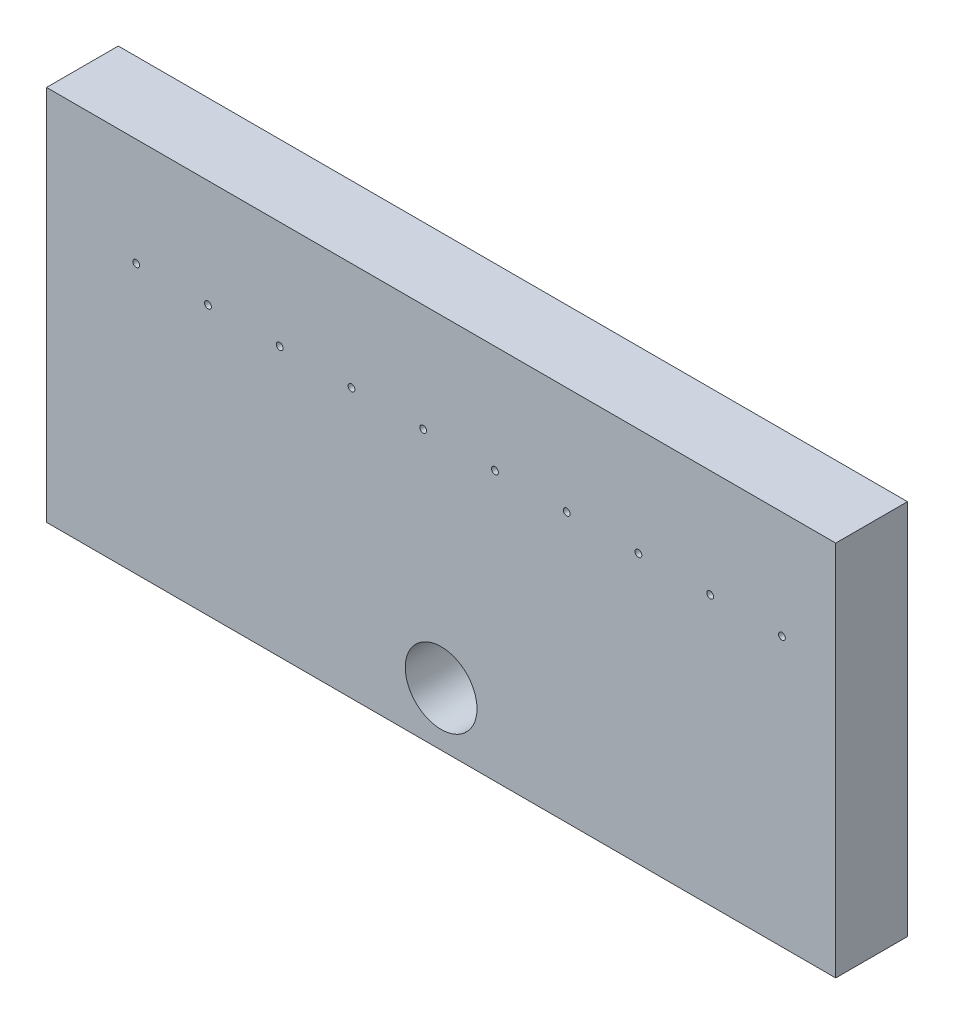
ISO-10303-21;
HEADER;
FILE_DESCRIPTION(('STEP AP214'),'2;1');
FILE_NAME('part.step','',(''),(''),'','','');
FILE_SCHEMA(('AUTOMOTIVE_DESIGN { 1 0 10303 214 1 1 1 1 }'));
ENDSEC;
DATA;
#1=APPLICATION_CONTEXT('core data for automotive mechanical design processes');
#2=APPLICATION_PROTOCOL_DEFINITION('international standard','automotive_design',2000,#1);
#3=PRODUCT_CONTEXT('',#1,'mechanical');
#4=PRODUCT('Part','Part','',(#3));
#5=PRODUCT_RELATED_PRODUCT_CATEGORY('part','',(#4));
#6=PRODUCT_DEFINITION_FORMATION('','',#4);
#7=PRODUCT_DEFINITION_CONTEXT('part definition',#1,'design');
#8=PRODUCT_DEFINITION('design','',#6,#7);
#9=PRODUCT_DEFINITION_SHAPE('','',#8);
#10=(LENGTH_UNIT() NAMED_UNIT(*) SI_UNIT(.MILLI.,.METRE.));
#11=(NAMED_UNIT(*) PLANE_ANGLE_UNIT() SI_UNIT($,.RADIAN.));
#12=(NAMED_UNIT(*) SI_UNIT($,.STERADIAN.) SOLID_ANGLE_UNIT());
#13=UNCERTAINTY_MEASURE_WITH_UNIT(LENGTH_MEASURE(1.E-05),#10,'distance_accuracy_value','');
#14=(GEOMETRIC_REPRESENTATION_CONTEXT(3) GLOBAL_UNCERTAINTY_ASSIGNED_CONTEXT((#13)) GLOBAL_UNIT_ASSIGNED_CONTEXT((#10,
#11,#12)) REPRESENTATION_CONTEXT('',''));
#15=CARTESIAN_POINT('',(0.,0.,0.));
#16=DIRECTION('',(0.,0.,1.));
#17=DIRECTION('',(1.,0.,0.));
#18=AXIS2_PLACEMENT_3D('',#15,#16,#17);
#19=CARTESIAN_POINT('',(1041.4,381.,50.8));
#20=DIRECTION('',(0.,0.,1.));
#21=DIRECTION('',(1.,0.,0.));
#22=AXIS2_PLACEMENT_3D('',#19,#20,#21);
#23=PLANE('',#22);
#24=CARTESIAN_POINT('',(1041.4,381.,50.8));
#25=DIRECTION('',(0.,0.,1.));
#26=DIRECTION('',(1.,0.,0.));
#27=AXIS2_PLACEMENT_3D('',#24,#25,#26);
#28=CIRCLE('',#27,4.826);
#29=CARTESIAN_POINT('',(1046.226,381.,50.8));
#30=VERTEX_POINT('',#29);
#31=EDGE_CURVE('E13',#30,#30,#28,.T.);
#32=ORIENTED_EDGE('',*,*,#31,.T.);
#33=EDGE_LOOP('',(#32));
#34=FACE_BOUND('',#33,.T.);
#35=ADVANCED_FACE('F44',(#34),#23,.T.);
#36=CARTESIAN_POINT('',(1041.4,381.,50.8));
#37=DIRECTION('',(0.,0.,1.));
#38=DIRECTION('',(1.,0.,0.));
#39=AXIS2_PLACEMENT_3D('',#36,#37,#38);
#40=CYLINDRICAL_SURFACE('',#39,4.826);
#41=ORIENTED_EDGE('',*,*,#31,.F.);
#42=EDGE_LOOP('',(#41));
#43=FACE_BOUND('',#42,.T.);
#44=CARTESIAN_POINT('',(1041.4,381.,101.6));
#45=DIRECTION('',(0.,0.,1.));
#46=DIRECTION('',(1.,0.,0.));
#47=AXIS2_PLACEMENT_3D('',#44,#45,#46);
#48=CIRCLE('',#47,4.826);
#49=CARTESIAN_POINT('',(1046.226,381.,101.6));
#50=VERTEX_POINT('',#49);
#51=EDGE_CURVE('E52',#50,#50,#48,.T.);
#52=ORIENTED_EDGE('',*,*,#51,.T.);
#53=EDGE_LOOP('',(#52));
#54=FACE_BOUND('',#53,.T.);
#55=ADVANCED_FACE('F166',(#43,#54),#40,.F.);
#56=CARTESIAN_POINT('',(939.8,381.,50.8));
#57=DIRECTION('',(0.,0.,1.));
#58=DIRECTION('',(1.,0.,0.));
#59=AXIS2_PLACEMENT_3D('',#56,#57,#58);
#60=PLANE('',#59);
#61=CARTESIAN_POINT('',(939.8,381.,50.8));
#62=DIRECTION('',(0.,0.,1.));
#63=DIRECTION('',(1.,0.,0.));
#64=AXIS2_PLACEMENT_3D('',#61,#62,#63);
#65=CIRCLE('',#64,4.826);
#66=CARTESIAN_POINT('',(944.626,381.,50.8));
#67=VERTEX_POINT('',#66);
#68=EDGE_CURVE('E161',#67,#67,#65,.T.);
#69=ORIENTED_EDGE('',*,*,#68,.T.);
#70=EDGE_LOOP('',(#69));
#71=FACE_BOUND('',#70,.T.);
#72=ADVANCED_FACE('F189',(#71),#60,.T.);
#73=CARTESIAN_POINT('',(939.8,381.,50.8));
#74=DIRECTION('',(0.,0.,1.));
#75=DIRECTION('',(1.,0.,0.));
#76=AXIS2_PLACEMENT_3D('',#73,#74,#75);
#77=CYLINDRICAL_SURFACE('',#76,4.826);
#78=ORIENTED_EDGE('',*,*,#68,.F.);
#79=EDGE_LOOP('',(#78));
#80=FACE_BOUND('',#79,.T.);
#81=CARTESIAN_POINT('',(939.8,381.,101.6));
#82=DIRECTION('',(0.,0.,1.));
#83=DIRECTION('',(1.,0.,0.));
#84=AXIS2_PLACEMENT_3D('',#81,#82,#83);
#85=CIRCLE('',#84,4.826);
#86=CARTESIAN_POINT('',(944.626,381.,101.6));
#87=VERTEX_POINT('',#86);
#88=EDGE_CURVE('E158',#87,#87,#85,.T.);
#89=ORIENTED_EDGE('',*,*,#88,.T.);
#90=EDGE_LOOP('',(#89));
#91=FACE_BOUND('',#90,.T.);
#92=ADVANCED_FACE('F195',(#80,#91),#77,.F.);
#93=CARTESIAN_POINT('',(838.2,381.,50.8));
#94=DIRECTION('',(0.,0.,1.));
#95=DIRECTION('',(1.,0.,0.));
#96=AXIS2_PLACEMENT_3D('',#93,#94,#95);
#97=PLANE('',#96);
#98=CARTESIAN_POINT('',(838.2,381.,50.8));
#99=DIRECTION('',(0.,0.,1.));
#100=DIRECTION('',(1.,0.,0.));
#101=AXIS2_PLACEMENT_3D('',#98,#99,#100);
#102=CIRCLE('',#101,4.826);
#103=CARTESIAN_POINT('',(843.026,381.,50.8));
#104=VERTEX_POINT('',#103);
#105=EDGE_CURVE('E155',#104,#104,#102,.T.);
#106=ORIENTED_EDGE('',*,*,#105,.T.);
#107=EDGE_LOOP('',(#106));
#108=FACE_BOUND('',#107,.T.);
#109=ADVANCED_FACE('F201',(#108),#97,.T.);
#110=CARTESIAN_POINT('',(838.2,381.,50.8));
#111=DIRECTION('',(0.,0.,1.));
#112=DIRECTION('',(1.,0.,0.));
#113=AXIS2_PLACEMENT_3D('',#110,#111,#112);
#114=CYLINDRICAL_SURFACE('',#113,4.826);
#115=ORIENTED_EDGE('',*,*,#105,.F.);
#116=EDGE_LOOP('',(#115));
#117=FACE_BOUND('',#116,.T.);
#118=CARTESIAN_POINT('',(838.2,381.,101.6));
#119=DIRECTION('',(0.,0.,1.));
#120=DIRECTION('',(1.,0.,0.));
#121=AXIS2_PLACEMENT_3D('',#118,#119,#120);
#122=CIRCLE('',#121,4.826);
#123=CARTESIAN_POINT('',(843.026,381.,101.6));
#124=VERTEX_POINT('',#123);
#125=EDGE_CURVE('E152',#124,#124,#122,.T.);
#126=ORIENTED_EDGE('',*,*,#125,.T.);
#127=EDGE_LOOP('',(#126));
#128=FACE_BOUND('',#127,.T.);
#129=ADVANCED_FACE('F205',(#117,#128),#114,.F.);
#130=CARTESIAN_POINT('',(736.6,381.,50.8));
#131=DIRECTION('',(0.,0.,1.));
#132=DIRECTION('',(1.,0.,0.));
#133=AXIS2_PLACEMENT_3D('',#130,#131,#132);
#134=PLANE('',#133);
#135=CARTESIAN_POINT('',(736.6,381.,50.8));
#136=DIRECTION('',(0.,0.,1.));
#137=DIRECTION('',(1.,0.,0.));
#138=AXIS2_PLACEMENT_3D('',#135,#136,#137);
#139=CIRCLE('',#138,4.826);
#140=CARTESIAN_POINT('',(741.426,381.,50.8));
#141=VERTEX_POINT('',#140);
#142=EDGE_CURVE('E149',#141,#141,#139,.T.);
#143=ORIENTED_EDGE('',*,*,#142,.T.);
#144=EDGE_LOOP('',(#143));
#145=FACE_BOUND('',#144,.T.);
#146=ADVANCED_FACE('F209',(#145),#134,.T.);
#147=CARTESIAN_POINT('',(736.6,381.,50.8));
#148=DIRECTION('',(0.,0.,1.));
#149=DIRECTION('',(1.,0.,0.));
#150=AXIS2_PLACEMENT_3D('',#147,#148,#149);
#151=CYLINDRICAL_SURFACE('',#150,4.826);
#152=ORIENTED_EDGE('',*,*,#142,.F.);
#153=EDGE_LOOP('',(#152));
#154=FACE_BOUND('',#153,.T.);
#155=CARTESIAN_POINT('',(736.6,381.,101.6));
#156=DIRECTION('',(0.,0.,1.));
#157=DIRECTION('',(1.,0.,0.));
#158=AXIS2_PLACEMENT_3D('',#155,#156,#157);
#159=CIRCLE('',#158,4.826);
#160=CARTESIAN_POINT('',(741.426,381.,101.6));
#161=VERTEX_POINT('',#160);
#162=EDGE_CURVE('E146',#161,#161,#159,.T.);
#163=ORIENTED_EDGE('',*,*,#162,.T.);
#164=EDGE_LOOP('',(#163));
#165=FACE_BOUND('',#164,.T.);
#166=ADVANCED_FACE('F213',(#154,#165),#151,.F.);
#167=CARTESIAN_POINT('',(635.,381.,50.8));
#168=DIRECTION('',(0.,0.,1.));
#169=DIRECTION('',(1.,0.,0.));
#170=AXIS2_PLACEMENT_3D('',#167,#168,#169);
#171=PLANE('',#170);
#172=CARTESIAN_POINT('',(635.,381.,50.8));
#173=DIRECTION('',(0.,0.,1.));
#174=DIRECTION('',(1.,0.,0.));
#175=AXIS2_PLACEMENT_3D('',#172,#173,#174);
#176=CIRCLE('',#175,4.826);
#177=CARTESIAN_POINT('',(639.826,381.,50.8));
#178=VERTEX_POINT('',#177);
#179=EDGE_CURVE('E143',#178,#178,#176,.T.);
#180=ORIENTED_EDGE('',*,*,#179,.T.);
#181=EDGE_LOOP('',(#180));
#182=FACE_BOUND('',#181,.T.);
#183=ADVANCED_FACE('F217',(#182),#171,.T.);
#184=CARTESIAN_POINT('',(635.,381.,50.8));
#185=DIRECTION('',(0.,0.,1.));
#186=DIRECTION('',(1.,0.,0.));
#187=AXIS2_PLACEMENT_3D('',#184,#185,#186);
#188=CYLINDRICAL_SURFACE('',#187,4.826);
#189=ORIENTED_EDGE('',*,*,#179,.F.);
#190=EDGE_LOOP('',(#189));
#191=FACE_BOUND('',#190,.T.);
#192=CARTESIAN_POINT('',(635.,381.,101.6));
#193=DIRECTION('',(0.,0.,1.));
#194=DIRECTION('',(1.,0.,0.));
#195=AXIS2_PLACEMENT_3D('',#192,#193,#194);
#196=CIRCLE('',#195,4.826);
#197=CARTESIAN_POINT('',(639.826,381.,101.6));
#198=VERTEX_POINT('',#197);
#199=EDGE_CURVE('E140',#198,#198,#196,.T.);
#200=ORIENTED_EDGE('',*,*,#199,.T.);
#201=EDGE_LOOP('',(#200));
#202=FACE_BOUND('',#201,.T.);
#203=ADVANCED_FACE('F221',(#191,#202),#188,.F.);
#204=CARTESIAN_POINT('',(533.4,381.,50.8));
#205=DIRECTION('',(0.,0.,1.));
#206=DIRECTION('',(1.,0.,0.));
#207=AXIS2_PLACEMENT_3D('',#204,#205,#206);
#208=PLANE('',#207);
#209=CARTESIAN_POINT('',(533.4,381.,50.8));
#210=DIRECTION('',(0.,0.,1.));
#211=DIRECTION('',(1.,0.,0.));
#212=AXIS2_PLACEMENT_3D('',#209,#210,#211);
#213=CIRCLE('',#212,4.826);
#214=CARTESIAN_POINT('',(538.226,381.,50.8));
#215=VERTEX_POINT('',#214);
#216=EDGE_CURVE('E137',#215,#215,#213,.T.);
#217=ORIENTED_EDGE('',*,*,#216,.T.);
#218=EDGE_LOOP('',(#217));
#219=FACE_BOUND('',#218,.T.);
#220=ADVANCED_FACE('F225',(#219),#208,.T.);
#221=CARTESIAN_POINT('',(533.4,381.,50.8));
#222=DIRECTION('',(0.,0.,1.));
#223=DIRECTION('',(1.,0.,0.));
#224=AXIS2_PLACEMENT_3D('',#221,#222,#223);
#225=CYLINDRICAL_SURFACE('',#224,4.826);
#226=ORIENTED_EDGE('',*,*,#216,.F.);
#227=EDGE_LOOP('',(#226));
#228=FACE_BOUND('',#227,.T.);
#229=CARTESIAN_POINT('',(533.4,381.,101.6));
#230=DIRECTION('',(0.,0.,1.));
#231=DIRECTION('',(1.,0.,0.));
#232=AXIS2_PLACEMENT_3D('',#229,#230,#231);
#233=CIRCLE('',#232,4.826);
#234=CARTESIAN_POINT('',(538.226,381.,101.6));
#235=VERTEX_POINT('',#234);
#236=EDGE_CURVE('E134',#235,#235,#233,.T.);
#237=ORIENTED_EDGE('',*,*,#236,.T.);
#238=EDGE_LOOP('',(#237));
#239=FACE_BOUND('',#238,.T.);
#240=ADVANCED_FACE('F229',(#228,#239),#225,.F.);
#241=CARTESIAN_POINT('',(431.8,381.,50.8));
#242=DIRECTION('',(0.,0.,1.));
#243=DIRECTION('',(1.,0.,0.));
#244=AXIS2_PLACEMENT_3D('',#241,#242,#243);
#245=PLANE('',#244);
#246=CARTESIAN_POINT('',(431.8,381.,50.8));
#247=DIRECTION('',(0.,0.,1.));
#248=DIRECTION('',(1.,0.,0.));
#249=AXIS2_PLACEMENT_3D('',#246,#247,#248);
#250=CIRCLE('',#249,4.826);
#251=CARTESIAN_POINT('',(436.626,381.,50.8));
#252=VERTEX_POINT('',#251);
#253=EDGE_CURVE('E131',#252,#252,#250,.T.);
#254=ORIENTED_EDGE('',*,*,#253,.T.);
#255=EDGE_LOOP('',(#254));
#256=FACE_BOUND('',#255,.T.);
#257=ADVANCED_FACE('F233',(#256),#245,.T.);
#258=CARTESIAN_POINT('',(431.8,381.,50.8));
#259=DIRECTION('',(0.,0.,1.));
#260=DIRECTION('',(1.,0.,0.));
#261=AXIS2_PLACEMENT_3D('',#258,#259,#260);
#262=CYLINDRICAL_SURFACE('',#261,4.826);
#263=ORIENTED_EDGE('',*,*,#253,.F.);
#264=EDGE_LOOP('',(#263));
#265=FACE_BOUND('',#264,.T.);
#266=CARTESIAN_POINT('',(431.8,381.,101.6));
#267=DIRECTION('',(0.,0.,1.));
#268=DIRECTION('',(1.,0.,0.));
#269=AXIS2_PLACEMENT_3D('',#266,#267,#268);
#270=CIRCLE('',#269,4.826);
#271=CARTESIAN_POINT('',(436.626,381.,101.6));
#272=VERTEX_POINT('',#271);
#273=EDGE_CURVE('E128',#272,#272,#270,.T.);
#274=ORIENTED_EDGE('',*,*,#273,.T.);
#275=EDGE_LOOP('',(#274));
#276=FACE_BOUND('',#275,.T.);
#277=ADVANCED_FACE('F237',(#265,#276),#262,.F.);
#278=CARTESIAN_POINT('',(330.2,381.,50.8));
#279=DIRECTION('',(0.,0.,1.));
#280=DIRECTION('',(1.,0.,0.));
#281=AXIS2_PLACEMENT_3D('',#278,#279,#280);
#282=PLANE('',#281);
#283=CARTESIAN_POINT('',(330.2,381.,50.8));
#284=DIRECTION('',(0.,0.,1.));
#285=DIRECTION('',(1.,0.,0.));
#286=AXIS2_PLACEMENT_3D('',#283,#284,#285);
#287=CIRCLE('',#286,4.826);
#288=CARTESIAN_POINT('',(335.026,381.,50.8));
#289=VERTEX_POINT('',#288);
#290=EDGE_CURVE('E125',#289,#289,#287,.T.);
#291=ORIENTED_EDGE('',*,*,#290,.T.);
#292=EDGE_LOOP('',(#291));
#293=FACE_BOUND('',#292,.T.);
#294=ADVANCED_FACE('F241',(#293),#282,.T.);
#295=CARTESIAN_POINT('',(330.2,381.,50.8));
#296=DIRECTION('',(0.,0.,1.));
#297=DIRECTION('',(1.,0.,0.));
#298=AXIS2_PLACEMENT_3D('',#295,#296,#297);
#299=CYLINDRICAL_SURFACE('',#298,4.826);
#300=ORIENTED_EDGE('',*,*,#290,.F.);
#301=EDGE_LOOP('',(#300));
#302=FACE_BOUND('',#301,.T.);
#303=CARTESIAN_POINT('',(330.2,381.,101.6));
#304=DIRECTION('',(0.,0.,1.));
#305=DIRECTION('',(1.,0.,0.));
#306=AXIS2_PLACEMENT_3D('',#303,#304,#305);
#307=CIRCLE('',#306,4.826);
#308=CARTESIAN_POINT('',(335.026,381.,101.6));
#309=VERTEX_POINT('',#308);
#310=EDGE_CURVE('E122',#309,#309,#307,.T.);
#311=ORIENTED_EDGE('',*,*,#310,.T.);
#312=EDGE_LOOP('',(#311));
#313=FACE_BOUND('',#312,.T.);
#314=ADVANCED_FACE('F245',(#302,#313),#299,.F.);
#315=CARTESIAN_POINT('',(0.,0.,101.6));
#316=DIRECTION('',(1.,0.,0.));
#317=DIRECTION('',(0.,0.,-1.));
#318=AXIS2_PLACEMENT_3D('',#315,#316,#317);
#319=PLANE('',#318);
#320=DIRECTION('',(0.,-1.,0.));
#321=VECTOR('',#320,1.);
#322=CARTESIAN_POINT('',(0.,0.,0.));
#323=LINE('',#322,#321);
#324=CARTESIAN_POINT('',(0.,533.4,0.));
#325=VERTEX_POINT('',#324);
#326=CARTESIAN_POINT('',(0.,0.,0.));
#327=VERTEX_POINT('',#326);
#328=EDGE_CURVE('E112',#325,#327,#323,.T.);
#329=ORIENTED_EDGE('',*,*,#328,.T.);
#330=DIRECTION('',(0.,0.,-1.));
#331=VECTOR('',#330,1.);
#332=CARTESIAN_POINT('',(0.,0.,101.6));
#333=LINE('',#332,#331);
#334=CARTESIAN_POINT('',(0.,0.,101.6));
#335=VERTEX_POINT('',#334);
#336=EDGE_CURVE('E103',#335,#327,#333,.T.);
#337=ORIENTED_EDGE('',*,*,#336,.F.);
#338=DIRECTION('',(0.,-1.,0.));
#339=VECTOR('',#338,1.);
#340=CARTESIAN_POINT('',(0.,0.,101.6));
#341=LINE('',#340,#339);
#342=CARTESIAN_POINT('',(0.,533.4,101.6));
#343=VERTEX_POINT('',#342);
#344=EDGE_CURVE('E97',#343,#335,#341,.T.);
#345=ORIENTED_EDGE('',*,*,#344,.F.);
#346=DIRECTION('',(0.,0.,-1.));
#347=VECTOR('',#346,1.);
#348=CARTESIAN_POINT('',(0.,533.4,101.6));
#349=LINE('',#348,#347);
#350=EDGE_CURVE('E108',#343,#325,#349,.T.);
#351=ORIENTED_EDGE('',*,*,#350,.T.);
#352=EDGE_LOOP('',(#329,#337,#345,#351));
#353=FACE_BOUND('',#352,.T.);
#354=ADVANCED_FACE('F249',(#353),#319,.F.);
#355=CARTESIAN_POINT('',(0.,0.,101.6));
#356=DIRECTION('',(0.,1.,0.));
#357=DIRECTION('',(0.,0.,1.));
#358=AXIS2_PLACEMENT_3D('',#355,#356,#357);
#359=PLANE('',#358);
#360=DIRECTION('',(1.,0.,0.));
#361=VECTOR('',#360,1.);
#362=CARTESIAN_POINT('',(0.,0.,0.));
#363=LINE('',#362,#361);
#364=CARTESIAN_POINT('',(1117.6,0.,0.));
#365=VERTEX_POINT('',#364);
#366=EDGE_CURVE('E102',#327,#365,#363,.T.);
#367=ORIENTED_EDGE('',*,*,#366,.T.);
#368=DIRECTION('',(0.,0.,-1.));
#369=VECTOR('',#368,1.);
#370=CARTESIAN_POINT('',(1117.6,0.,101.6));
#371=LINE('',#370,#369);
#372=CARTESIAN_POINT('',(1117.6,0.,101.6));
#373=VERTEX_POINT('',#372);
#374=EDGE_CURVE('E100',#373,#365,#371,.T.);
#375=ORIENTED_EDGE('',*,*,#374,.F.);
#376=DIRECTION('',(1.,0.,0.));
#377=VECTOR('',#376,1.);
#378=CARTESIAN_POINT('',(0.,0.,101.6));
#379=LINE('',#378,#377);
#380=EDGE_CURVE('E91',#335,#373,#379,.T.);
#381=ORIENTED_EDGE('',*,*,#380,.F.);
#382=ORIENTED_EDGE('',*,*,#336,.T.);
#383=EDGE_LOOP('',(#367,#375,#381,#382));
#384=FACE_BOUND('',#383,.T.);
#385=ADVANCED_FACE('F101',(#384),#359,.F.);
#386=CARTESIAN_POINT('',(1117.6,0.,101.6));
#387=DIRECTION('',(-1.,0.,0.));
#388=DIRECTION('',(0.,0.,1.));
#389=AXIS2_PLACEMENT_3D('',#386,#387,#388);
#390=PLANE('',#389);
#391=DIRECTION('',(0.,1.,0.));
#392=VECTOR('',#391,1.);
#393=CARTESIAN_POINT('',(1117.6,0.,0.));
#394=LINE('',#393,#392);
#395=CARTESIAN_POINT('',(1117.6,533.4,0.));
#396=VERTEX_POINT('',#395);
#397=EDGE_CURVE('E77',#365,#396,#394,.T.);
#398=ORIENTED_EDGE('',*,*,#397,.T.);
#399=DIRECTION('',(0.,0.,-1.));
#400=VECTOR('',#399,1.);
#401=CARTESIAN_POINT('',(1117.6,533.4,101.6));
#402=LINE('',#401,#400);
#403=CARTESIAN_POINT('',(1117.6,533.4,101.6));
#404=VERTEX_POINT('',#403);
#405=EDGE_CURVE('E104',#404,#396,#402,.T.);
#406=ORIENTED_EDGE('',*,*,#405,.F.);
#407=DIRECTION('',(0.,1.,0.));
#408=VECTOR('',#407,1.);
#409=CARTESIAN_POINT('',(1117.6,0.,101.6));
#410=LINE('',#409,#408);
#411=EDGE_CURVE('E95',#373,#404,#410,.T.);
#412=ORIENTED_EDGE('',*,*,#411,.F.);
#413=ORIENTED_EDGE('',*,*,#374,.T.);
#414=EDGE_LOOP('',(#398,#406,#412,#413));
#415=FACE_BOUND('',#414,.T.);
#416=ADVANCED_FACE('F106',(#415),#390,.F.);
#417=CARTESIAN_POINT('',(0.,533.4,101.6));
#418=DIRECTION('',(0.,-1.,0.));
#419=DIRECTION('',(0.,0.,-1.));
#420=AXIS2_PLACEMENT_3D('',#417,#418,#419);
#421=PLANE('',#420);
#422=DIRECTION('',(-1.,0.,0.));
#423=VECTOR('',#422,1.);
#424=CARTESIAN_POINT('',(0.,533.4,0.));
#425=LINE('',#424,#423);
#426=EDGE_CURVE('E83',#396,#325,#425,.T.);
#427=ORIENTED_EDGE('',*,*,#426,.T.);
#428=ORIENTED_EDGE('',*,*,#350,.F.);
#429=DIRECTION('',(-1.,0.,0.));
#430=VECTOR('',#429,1.);
#431=CARTESIAN_POINT('',(0.,533.4,101.6));
#432=LINE('',#431,#430);
#433=EDGE_CURVE('E60',#404,#343,#432,.T.);
#434=ORIENTED_EDGE('',*,*,#433,.F.);
#435=ORIENTED_EDGE('',*,*,#405,.T.);
#436=EDGE_LOOP('',(#427,#428,#434,#435));
#437=FACE_BOUND('',#436,.T.);
#438=ADVANCED_FACE('F170',(#437),#421,.F.);
#439=CARTESIAN_POINT('',(0.,0.,101.6));
#440=DIRECTION('',(0.,0.,-1.));
#441=DIRECTION('',(-1.,0.,0.));
#442=AXIS2_PLACEMENT_3D('',#439,#440,#441);
#443=PLANE('',#442);
#444=CARTESIAN_POINT('',(558.8,76.2,101.6));
#445=DIRECTION('',(0.,0.,1.));
#446=DIRECTION('',(1.,0.,0.));
#447=AXIS2_PLACEMENT_3D('',#444,#445,#446);
#448=CIRCLE('',#447,50.8);
#449=CARTESIAN_POINT('',(609.6,76.2,101.6));
#450=VERTEX_POINT('',#449);
#451=EDGE_CURVE('E424',#450,#450,#448,.T.);
#452=ORIENTED_EDGE('',*,*,#451,.F.);
#453=EDGE_LOOP('',(#452));
#454=FACE_BOUND('',#453,.T.);
#455=CARTESIAN_POINT('',(228.6,381.,101.6));
#456=DIRECTION('',(0.,0.,1.));
#457=DIRECTION('',(1.,0.,0.));
#458=AXIS2_PLACEMENT_3D('',#455,#456,#457);
#459=CIRCLE('',#458,4.826);
#460=CARTESIAN_POINT('',(233.426,381.,101.6));
#461=VERTEX_POINT('',#460);
#462=EDGE_CURVE('E426',#461,#461,#459,.T.);
#463=ORIENTED_EDGE('',*,*,#462,.F.);
#464=EDGE_LOOP('',(#463));
#465=FACE_BOUND('',#464,.T.);
#466=CARTESIAN_POINT('',(127.,381.,101.6));
#467=DIRECTION('',(0.,0.,1.));
#468=DIRECTION('',(1.,0.,0.));
#469=AXIS2_PLACEMENT_3D('',#466,#467,#468);
#470=CIRCLE('',#469,4.826);
#471=CARTESIAN_POINT('',(131.826,381.,101.6));
#472=VERTEX_POINT('',#471);
#473=EDGE_CURVE('E434',#472,#472,#470,.T.);
#474=ORIENTED_EDGE('',*,*,#473,.F.);
#475=EDGE_LOOP('',(#474));
#476=FACE_BOUND('',#475,.T.);
#477=ORIENTED_EDGE('',*,*,#344,.T.);
#478=ORIENTED_EDGE('',*,*,#380,.T.);
#479=ORIENTED_EDGE('',*,*,#411,.T.);
#480=ORIENTED_EDGE('',*,*,#433,.T.);
#481=EDGE_LOOP('',(#477,#478,#479,#480));
#482=FACE_BOUND('',#481,.T.);
#483=ORIENTED_EDGE('',*,*,#310,.F.);
#484=EDGE_LOOP('',(#483));
#485=FACE_BOUND('',#484,.T.);
#486=ORIENTED_EDGE('',*,*,#273,.F.);
#487=EDGE_LOOP('',(#486));
#488=FACE_BOUND('',#487,.T.);
#489=ORIENTED_EDGE('',*,*,#236,.F.);
#490=EDGE_LOOP('',(#489));
#491=FACE_BOUND('',#490,.T.);
#492=ORIENTED_EDGE('',*,*,#199,.F.);
#493=EDGE_LOOP('',(#492));
#494=FACE_BOUND('',#493,.T.);
#495=ORIENTED_EDGE('',*,*,#162,.F.);
#496=EDGE_LOOP('',(#495));
#497=FACE_BOUND('',#496,.T.);
#498=ORIENTED_EDGE('',*,*,#125,.F.);
#499=EDGE_LOOP('',(#498));
#500=FACE_BOUND('',#499,.T.);
#501=ORIENTED_EDGE('',*,*,#88,.F.);
#502=EDGE_LOOP('',(#501));
#503=FACE_BOUND('',#502,.T.);
#504=ORIENTED_EDGE('',*,*,#51,.F.);
#505=EDGE_LOOP('',(#504));
#506=FACE_BOUND('',#505,.T.);
#507=ADVANCED_FACE('F92',(#454,#465,#476,#482,#485,#488,#491,#494,#497,#500,#503,#506),#443,.F.);
#508=CARTESIAN_POINT('',(0.,0.,0.));
#509=DIRECTION('',(0.,0.,-1.));
#510=DIRECTION('',(-1.,0.,0.));
#511=AXIS2_PLACEMENT_3D('',#508,#509,#510);
#512=PLANE('',#511);
#513=CARTESIAN_POINT('',(558.8,76.2,0.));
#514=DIRECTION('',(0.,0.,1.));
#515=DIRECTION('',(1.,0.,0.));
#516=AXIS2_PLACEMENT_3D('',#513,#514,#515);
#517=CIRCLE('',#516,50.8);
#518=CARTESIAN_POINT('',(609.6,76.2,0.));
#519=VERTEX_POINT('',#518);
#520=EDGE_CURVE('E422',#519,#519,#517,.T.);
#521=ORIENTED_EDGE('',*,*,#520,.T.);
#522=EDGE_LOOP('',(#521));
#523=FACE_BOUND('',#522,.T.);
#524=ORIENTED_EDGE('',*,*,#328,.F.);
#525=ORIENTED_EDGE('',*,*,#426,.F.);
#526=ORIENTED_EDGE('',*,*,#397,.F.);
#527=ORIENTED_EDGE('',*,*,#366,.F.);
#528=EDGE_LOOP('',(#524,#525,#526,#527));
#529=FACE_BOUND('',#528,.T.);
#530=ADVANCED_FACE('F169',(#523,#529),#512,.T.);
#531=CARTESIAN_POINT('',(127.,381.,50.8));
#532=DIRECTION('',(0.,0.,1.));
#533=DIRECTION('',(1.,0.,0.));
#534=AXIS2_PLACEMENT_3D('',#531,#532,#533);
#535=CYLINDRICAL_SURFACE('',#534,4.826);
#536=CARTESIAN_POINT('',(127.,381.,50.8));
#537=DIRECTION('',(0.,0.,1.));
#538=DIRECTION('',(1.,0.,0.));
#539=AXIS2_PLACEMENT_3D('',#536,#537,#538);
#540=CIRCLE('',#539,4.826);
#541=CARTESIAN_POINT('',(131.826,381.,50.8));
#542=VERTEX_POINT('',#541);
#543=EDGE_CURVE('E115',#542,#542,#540,.T.);
#544=ORIENTED_EDGE('',*,*,#543,.F.);
#545=EDGE_LOOP('',(#544));
#546=FACE_BOUND('',#545,.T.);
#547=ORIENTED_EDGE('',*,*,#473,.T.);
#548=EDGE_LOOP('',(#547));
#549=FACE_BOUND('',#548,.T.);
#550=ADVANCED_FACE('F177',(#546,#549),#535,.F.);
#551=CARTESIAN_POINT('',(127.,381.,50.8));
#552=DIRECTION('',(0.,0.,1.));
#553=DIRECTION('',(1.,0.,0.));
#554=AXIS2_PLACEMENT_3D('',#551,#552,#553);
#555=PLANE('',#554);
#556=ORIENTED_EDGE('',*,*,#543,.T.);
#557=EDGE_LOOP('',(#556));
#558=FACE_BOUND('',#557,.T.);
#559=ADVANCED_FACE('F275',(#558),#555,.T.);
#560=CARTESIAN_POINT('',(228.6,381.,50.8));
#561=DIRECTION('',(0.,0.,1.));
#562=DIRECTION('',(1.,0.,0.));
#563=AXIS2_PLACEMENT_3D('',#560,#561,#562);
#564=CYLINDRICAL_SURFACE('',#563,4.826);
#565=CARTESIAN_POINT('',(228.6,381.,50.8));
#566=DIRECTION('',(0.,0.,1.));
#567=DIRECTION('',(1.,0.,0.));
#568=AXIS2_PLACEMENT_3D('',#565,#566,#567);
#569=CIRCLE('',#568,4.826);
#570=CARTESIAN_POINT('',(233.426,381.,50.8));
#571=VERTEX_POINT('',#570);
#572=EDGE_CURVE('E431',#571,#571,#569,.T.);
#573=ORIENTED_EDGE('',*,*,#572,.F.);
#574=EDGE_LOOP('',(#573));
#575=FACE_BOUND('',#574,.T.);
#576=ORIENTED_EDGE('',*,*,#462,.T.);
#577=EDGE_LOOP('',(#576));
#578=FACE_BOUND('',#577,.T.);
#579=ADVANCED_FACE('F284',(#575,#578),#564,.F.);
#580=CARTESIAN_POINT('',(228.6,381.,50.8));
#581=DIRECTION('',(0.,0.,1.));
#582=DIRECTION('',(1.,0.,0.));
#583=AXIS2_PLACEMENT_3D('',#580,#581,#582);
#584=PLANE('',#583);
#585=ORIENTED_EDGE('',*,*,#572,.T.);
#586=EDGE_LOOP('',(#585));
#587=FACE_BOUND('',#586,.T.);
#588=ADVANCED_FACE('F387',(#587),#584,.T.);
#589=CARTESIAN_POINT('',(558.8,76.2,0.));
#590=DIRECTION('',(0.,0.,1.));
#591=DIRECTION('',(1.,0.,0.));
#592=AXIS2_PLACEMENT_3D('',#589,#590,#591);
#593=CYLINDRICAL_SURFACE('',#592,50.8);
#594=ORIENTED_EDGE('',*,*,#520,.F.);
#595=EDGE_LOOP('',(#594));
#596=FACE_BOUND('',#595,.T.);
#597=ORIENTED_EDGE('',*,*,#451,.T.);
#598=EDGE_LOOP('',(#597));
#599=FACE_BOUND('',#598,.T.);
#600=ADVANCED_FACE('F396',(#596,#599),#593,.F.);
#601=CLOSED_SHELL('',(#35,#55,#72,#92,#109,#129,#146,#166,#183,#203,#220,#240,#257,#277,#294,
#314,#354,#385,#416,#438,#507,#530,#550,#559,#579,#588,#600));
#602=MANIFOLD_SOLID_BREP('B2',#601);
#603=ADVANCED_BREP_SHAPE_REPRESENTATION('',(#18,#602),#14);
#604=SHAPE_DEFINITION_REPRESENTATION(#9,#603);
ENDSEC;
END-ISO-10303-21;
